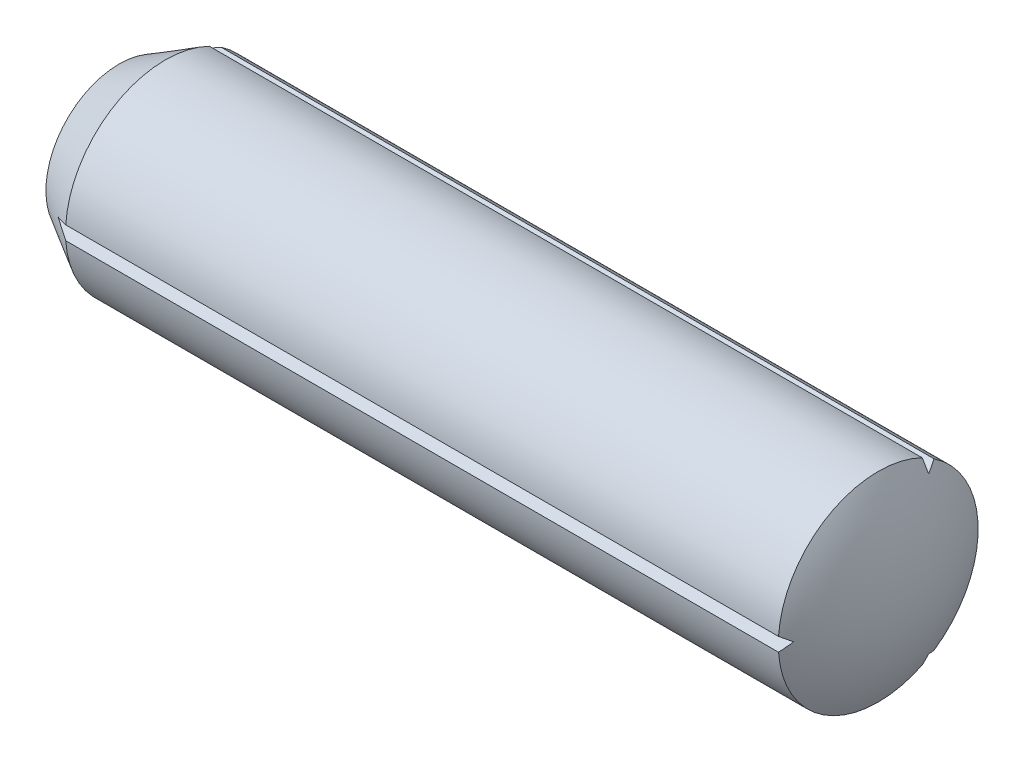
from build123d import *

# Parameters (mm, degrees)
CUT_EXTRUDE1_DEPTH = 102.550480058
CIRPATTERN2_COUNT  = 3


with BuildPart() as part:
    # Sketch1 → Base-Revolve (revolve)
    with BuildSketch(Plane.XY):
        with BuildLine():
            Line((-92.5, 12.5), (-98.294957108, 9.154279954))
            ThreePointArc((-98.294957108, 9.154279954), (-99.46916936, 5.271532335), (-100, 1.25))
            Line((-100, 1.25), (-100, 0))
            Line((-100, 0), (0, 0))
            ThreePointArc((0, 0), (-0.851854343, 6.470476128), (-3.349364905, 12.5))
            Line((-3.349364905, 12.5), (-92.5, 12.5))
        make_face()
    revolve(axis=Axis((-117, 0, 0), (1, 0, 0)))

    # Sketch2 → Cut-Extrude1 (cut, through all)
    with BuildSketch(Plane(origin=(0, 0, 0), x_dir=(0, 0, -1), z_dir=(1, 0, 0))):
        Polygon((-11.25, 0), (-12.5, 0.875259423), (-12.5, -0.875259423), align=None)
    cut_extrude1 = extrude(amount=-CUT_EXTRUDE1_DEPTH, mode=Mode.SUBTRACT)

    # CirPattern2: Cut-Extrude1 ×3 about axis
    cirpattern2_axis = Axis((0, 0, 0), (1, 0, 0))
    for i in range(1, CIRPATTERN2_COUNT):
        add(cut_extrude1.rotate(cirpattern2_axis, i * 360 / CIRPATTERN2_COUNT), mode=Mode.SUBTRACT)


solid = part.part
